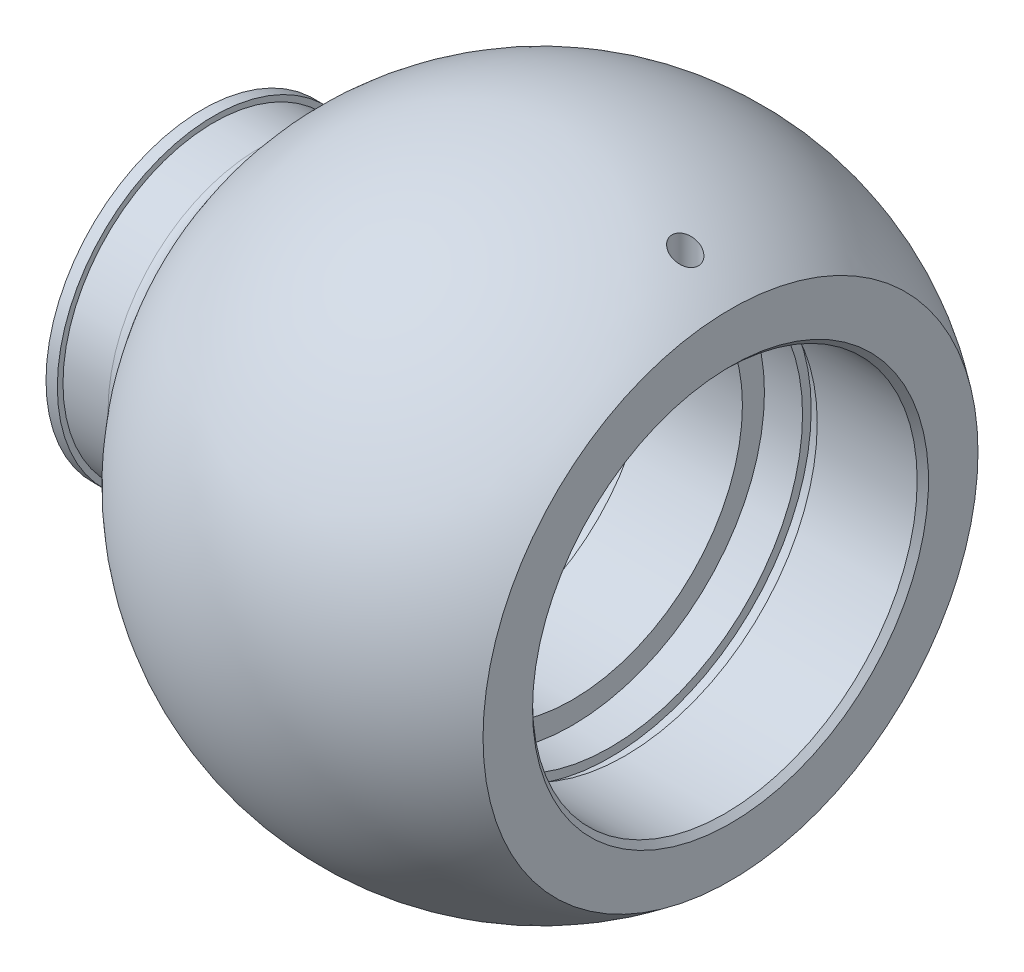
from build123d import *

# Parameters (mm, degrees)
ESQUISSE2_R      = 3.5
EXTRUSION1_DEPTH = 97


with BuildPart() as part:
    # Esquisse1 → R_volution1 (revolve)
    with BuildSketch(Plane.XY, mode=Mode.PRIVATE) as r_volution1_sk:
        with BuildLine():
            Line((0, 41.5), (0, 27.75))
            Line((0, 27.75), (2, 27.75))
            Line((2, 27.75), (2, 29))
            Line((2, 29), (7, 29))
            Line((7, 29), (7, 25))
            Line((7, 25), (12, 25))
            Line((12, 25), (12, 30))
            Line((12, 30), (23, 30))
            Line((23, 30), (23, 25))
            Line((23, 25), (68, 25))
            Line((68, 25), (68, 48))
            Line((68, 48), (73, 48))
            Line((73, 48), (73, 45.16))
            Line((73, 45.16), (98, 45.16))
            Line((98, 45.16), (98, 51))
            Line((98, 51), (108.1, 51))
            Line((108.1, 51), (108.1, 53.3))
            Line((108.1, 53.3), (112, 53.3))
            Line((112, 53.3), (112, 51))
            Line((112, 51), (138.5, 51))
            Line((138.5, 51), (140, 52.5))
            Line((140, 52.5), (140, 65.622023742))
            ThreePointArc((140, 65.622023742), (74.43845682, 81.019061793), (19.246439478, 42.428571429))
            ThreePointArc((19.246439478, 42.428571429), (17.422371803, 40.649302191), (14.958344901, 40))
            Line((14.958344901, 40), (3, 40))
            Line((3, 40), (3, 41.5))
            Line((3, 41.5), (0, 41.5))
        make_face()
    revolve(r_volution1_sk.sketch.rotate(Axis((-14.501348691, 0, 0), (1, 0, 0)), 90), axis=Axis((-14.501348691, 0, 0), (1, 0, 0)))

    # Esquisse2 → Extrusion1 (cut)
    with BuildSketch(Plane(origin=(0, 0, 0), x_dir=(1, 0, 0), z_dir=(0, 1, 0))):
        with Locations(Location((128, 0, 0), (0, 0, 90))):
            Circle(ESQUISSE2_R)
    extrude(amount=EXTRUSION1_DEPTH, mode=Mode.SUBTRACT)


solid = part.part
